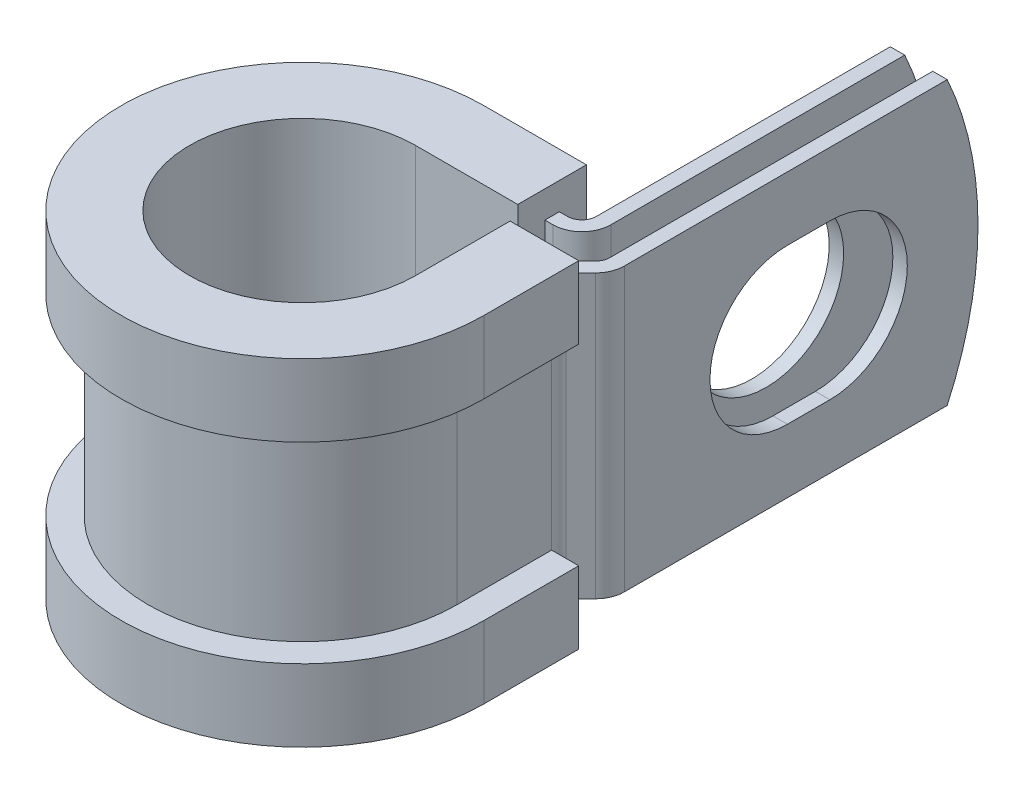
from build123d import *

# Parameters (mm, degrees)
EXTRUDE_THIN1_DEPTH = 7.9375
SKETCH2_R           = 4.3561
CUT_EXTRUDE1_DEPTH  = 0.8128
CUT_EXTRUDE2_DEPTH  = 0.8128
CUT_EXTRUDE3_DEPTH  = 33.87339464


with BuildPart() as part:
    # Sketch1 → Extrude-Thin1 (new, symmetric)
    with BuildSketch(Plane(origin=(0, 0, 0), x_dir=(1, 0, 0), z_dir=(0, 1, 0))):
        with BuildLine():
            Line((9.414374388, 27.7622), (9.414374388, 7.874))
            ThreePointArc((9.414374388, 7.874), (9.352503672, 7.562954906), (9.17631078, 7.299263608))
            Line((9.17631078, 7.299263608), (8.350127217, 6.473080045))
            ThreePointArc((8.350127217, 6.473080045), (7.997741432, 5.945697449), (7.874, 5.323607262))
            Line((7.874, 5.323607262), (7.874, 0))
            ThreePointArc((7.874, 0), (-5.567758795, -5.567758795), (0, 7.874))
            Line((0, 7.874), (6.213974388, 7.874))
            ThreePointArc((6.213974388, 7.874), (7.363447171, 8.350127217), (7.839574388, 9.4996))
            Line((7.839574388, 9.4996), (7.839574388, 27.7622))
            Line((7.839574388, 27.7622), (7.026774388, 27.7622))
            Line((7.026774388, 27.7622), (7.026774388, 9.4996))
            ThreePointArc((7.026774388, 9.4996), (6.78871078, 8.924863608), (6.213974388, 8.6868))
            Line((6.213974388, 8.6868), (0, 8.6868))
            ThreePointArc((0, 8.6868), (-6.142495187, -6.142495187), (8.6868, 0))
            Line((8.6868, 0), (8.6868, 5.323607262))
            ThreePointArc((8.6868, 5.323607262), (8.748670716, 5.634652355), (8.924863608, 5.898343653))
            Line((8.924863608, 5.898343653), (9.751047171, 6.724527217))
            ThreePointArc((9.751047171, 6.724527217), (10.103432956, 7.251909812), (10.227174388, 7.874))
            Line((10.227174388, 7.874), (10.227174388, 27.7622))
            Line((10.227174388, 27.7622), (9.414374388, 27.7622))
        make_face()
    extrude(amount=EXTRUDE_THIN1_DEPTH, both=True)

    # Sketch2 → Cut-Extrude1 (cut)
    with BuildSketch(Plane.ZY.offset(-7.026774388)):
        with Locations((-18.2372, 0)):
            Circle(SKETCH2_R)
    extrude(amount=-CUT_EXTRUDE1_DEPTH, mode=Mode.SUBTRACT)

    # Sketch3 → Cut-Extrude2 (cut)
    with BuildSketch(Plane(origin=(10.227174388, 0, 0), x_dir=(0, 0, -1), z_dir=(1, 0, 0))):
        with BuildLine():
            Line((17.0434, 4.3561), (19.431, 4.3561))
            ThreePointArc((19.431, 4.3561), (23.7871, 0), (19.431, -4.3561))
            Line((19.431, -4.3561), (17.0434, -4.3561))
            ThreePointArc((17.0434, -4.3561), (12.6873, 0), (17.0434, 4.3561))
        make_face()
    extrude(amount=-CUT_EXTRUDE2_DEPTH, mode=Mode.SUBTRACT)

    # Sketch4 → Cut-Extrude3 (cut, through all)
    with BuildSketch(Plane.ZY.offset(-7.026774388)):
        with BuildLine():
            Line((-26.029780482, 7.9375), (-27.7622, 7.9375))
            Line((-27.7622, 7.9375), (-27.7622, 0))
            ThreePointArc((-27.7622, 0), (-27.324056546, 4.062178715), (-26.029780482, 7.9375))
        make_face()
        with BuildLine():
            ThreePointArc((-26.029780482, -7.9375), (-27.324056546, -4.062178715), (-27.7622, 0))
            Line((-27.7622, 0), (-27.7622, -7.9375))
            Line((-27.7622, -7.9375), (-26.029780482, -7.9375))
        make_face()
    extrude(amount=-CUT_EXTRUDE3_DEPTH, mode=Mode.SUBTRACT)

    # Sweep1: sweep along a path in Sketch6
    with BuildLine(Plane(origin=(0, 7.9375, 0), x_dir=(1, 0, 0), z_dir=(0, 1, 0))) as sweep1_path:
        Line((6.35, 5.323607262), (6.35, 0))
        ThreePointArc((6.35, 0), (-4.490128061, -4.490128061), (0, 6.35))
        Line((0, 6.35), (5.756774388, 6.35))
    # Sketch5 → Sweep1 (sweep)
    with BuildSketch(Plane(origin=(0, 0, -5.323607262), x_dir=(-1, 0, 0), z_dir=(0, 0, -1))):
        Polygon((-8.6868, 7.9375), (-7.874, 7.9375), (-7.874, -7.9375), (-8.6868, -7.9375), (-8.6868, -5.3975), (-10.2108, -5.3975), (-10.2108, -9.4615), (-6.35, -9.4615), (-6.35, 9.4615), (-10.2108, 9.4615), (-10.2108, 5.3975), (-8.6868, 5.3975), align=None)
    sweep(path=sweep1_path.line)


solid = part.part
